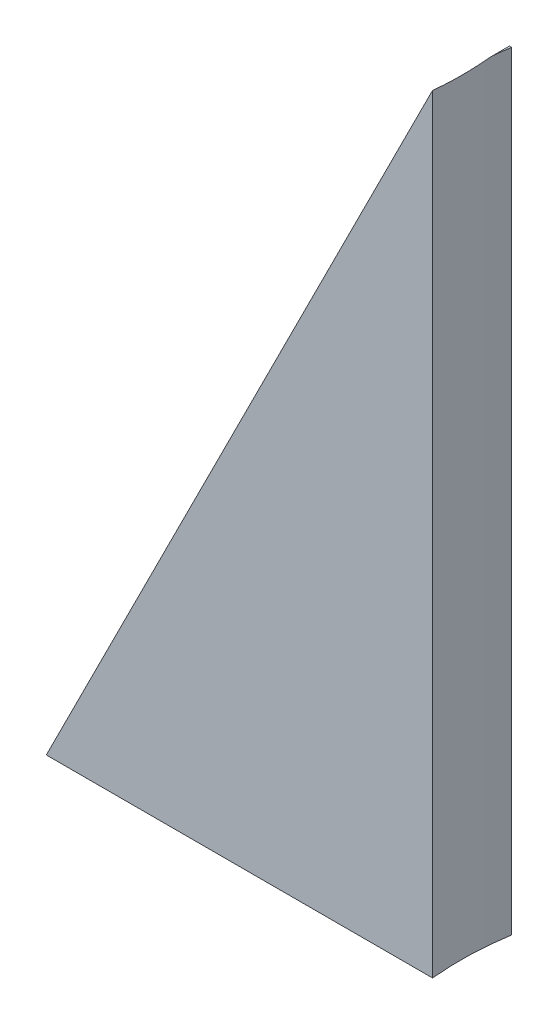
ISO-10303-21;
HEADER;
FILE_DESCRIPTION(('STEP AP214'),'2;1');
FILE_NAME('part.step','',(''),(''),'','','');
FILE_SCHEMA(('AUTOMOTIVE_DESIGN { 1 0 10303 214 1 1 1 1 }'));
ENDSEC;
DATA;
#1=APPLICATION_CONTEXT('core data for automotive mechanical design processes');
#2=APPLICATION_PROTOCOL_DEFINITION('international standard','automotive_design',2000,#1);
#3=PRODUCT_CONTEXT('',#1,'mechanical');
#4=PRODUCT('Part','Part','',(#3));
#5=PRODUCT_RELATED_PRODUCT_CATEGORY('part','',(#4));
#6=PRODUCT_DEFINITION_FORMATION('','',#4);
#7=PRODUCT_DEFINITION_CONTEXT('part definition',#1,'design');
#8=PRODUCT_DEFINITION('design','',#6,#7);
#9=PRODUCT_DEFINITION_SHAPE('','',#8);
#10=(LENGTH_UNIT() NAMED_UNIT(*) SI_UNIT(.MILLI.,.METRE.));
#11=(NAMED_UNIT(*) PLANE_ANGLE_UNIT() SI_UNIT($,.RADIAN.));
#12=(NAMED_UNIT(*) SI_UNIT($,.STERADIAN.) SOLID_ANGLE_UNIT());
#13=UNCERTAINTY_MEASURE_WITH_UNIT(LENGTH_MEASURE(1.E-05),#10,'distance_accuracy_value','');
#14=(GEOMETRIC_REPRESENTATION_CONTEXT(3) GLOBAL_UNCERTAINTY_ASSIGNED_CONTEXT((#13)) GLOBAL_UNIT_ASSIGNED_CONTEXT((#10,
#11,#12)) REPRESENTATION_CONTEXT('',''));
#15=CARTESIAN_POINT('',(0.,0.,0.));
#16=DIRECTION('',(0.,0.,1.));
#17=DIRECTION('',(1.,0.,0.));
#18=AXIS2_PLACEMENT_3D('',#15,#16,#17);
#19=CARTESIAN_POINT('',(127.612782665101,200.,2.25));
#20=DIRECTION('',(0.,-1.,0.));
#21=DIRECTION('',(0.,0.,-1.));
#22=AXIS2_PLACEMENT_3D('',#19,#20,#21);
#23=CYLINDRICAL_SURFACE('',#22,77.5);
#24=CARTESIAN_POINT('',(127.612782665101,353.453855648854,2.25));
#25=DIRECTION('',(0.893529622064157,-0.449004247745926,0.));
#26=DIRECTION('',(-0.449004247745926,-0.893529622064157,0.));
#27=AXIS2_PLACEMENT_3D('',#24,#25,#26);
#28=ELLIPSE('',#27,172.604157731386,77.5);
#29=CARTESIAN_POINT('',(50.5012562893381,200.,10.));
#30=VERTEX_POINT('',#29);
#31=CARTESIAN_POINT('',(50.5012562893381,200.,-5.50000000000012));
#32=VERTEX_POINT('',#31);
#33=EDGE_CURVE('E79',#30,#32,#28,.T.);
#34=ORIENTED_EDGE('',*,*,#33,.F.);
#35=DIRECTION('',(0.,-1.,0.));
#36=VECTOR('',#35,1.);
#37=CARTESIAN_POINT('',(50.5012562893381,200.,10.));
#38=LINE('',#37,#36);
#39=CARTESIAN_POINT('',(50.5012562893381,0.,10.));
#40=VERTEX_POINT('',#39);
#41=EDGE_CURVE('E48',#30,#40,#38,.T.);
#42=ORIENTED_EDGE('',*,*,#41,.T.);
#43=CARTESIAN_POINT('',(127.612782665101,0.,2.25));
#44=DIRECTION('',(0.,1.,0.));
#45=DIRECTION('',(0.,0.,1.));
#46=AXIS2_PLACEMENT_3D('',#43,#44,#45);
#47=CIRCLE('',#46,77.5);
#48=CARTESIAN_POINT('',(51.0870516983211,0.,-9.99999999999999));
#49=VERTEX_POINT('',#48);
#50=EDGE_CURVE('E87',#49,#40,#47,.T.);
#51=ORIENTED_EDGE('',*,*,#50,.F.);
#52=DIRECTION('',(0.,-1.,0.));
#53=VECTOR('',#52,1.);
#54=CARTESIAN_POINT('',(51.0870516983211,200.,-9.99999999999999));
#55=LINE('',#54,#53);
#56=CARTESIAN_POINT('',(51.0870516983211,200.,-9.99999999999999));
#57=VERTEX_POINT('',#56);
#58=EDGE_CURVE('E11',#57,#49,#55,.T.);
#59=ORIENTED_EDGE('',*,*,#58,.F.);
#60=CARTESIAN_POINT('',(127.612782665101,200.,2.25));
#61=DIRECTION('',(0.,1.,0.));
#62=DIRECTION('',(0.,0.,1.));
#63=AXIS2_PLACEMENT_3D('',#60,#61,#62);
#64=CIRCLE('',#63,77.5);
#65=EDGE_CURVE('E94',#57,#32,#64,.T.);
#66=ORIENTED_EDGE('',*,*,#65,.T.);
#67=EDGE_LOOP('',(#34,#42,#51,#59,#66));
#68=FACE_BOUND('',#67,.T.);
#69=ADVANCED_FACE('F40',(#68),#23,.F.);
#70=CARTESIAN_POINT('',(0.,200.,-9.99999999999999));
#71=DIRECTION('',(0.,0.,-1.));
#72=DIRECTION('',(-1.,0.,0.));
#73=AXIS2_PLACEMENT_3D('',#70,#71,#72);
#74=PLANE('',#73);
#75=DIRECTION('',(-0.449004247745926,-0.893529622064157,0.));
#76=VECTOR('',#75,1.);
#77=CARTESIAN_POINT('',(40.3199598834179,179.738966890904,-9.99999999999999));
#78=LINE('',#77,#76);
#79=CARTESIAN_POINT('',(50.5012562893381,200.,-10.));
#80=VERTEX_POINT('',#79);
#81=CARTESIAN_POINT('',(-50.,0.,-9.99999999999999));
#82=VERTEX_POINT('',#81);
#83=EDGE_CURVE('E67',#80,#82,#78,.T.);
#84=ORIENTED_EDGE('',*,*,#83,.F.);
#85=DIRECTION('',(1.,0.,0.));
#86=VECTOR('',#85,1.);
#87=CARTESIAN_POINT('',(0.,200.,-9.99999999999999));
#88=LINE('',#87,#86);
#89=EDGE_CURVE('E54',#80,#57,#88,.T.);
#90=ORIENTED_EDGE('',*,*,#89,.T.);
#91=ORIENTED_EDGE('',*,*,#58,.T.);
#92=DIRECTION('',(1.,0.,0.));
#93=VECTOR('',#92,1.);
#94=CARTESIAN_POINT('',(0.,0.,-9.99999999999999));
#95=LINE('',#94,#93);
#96=EDGE_CURVE('E82',#82,#49,#95,.T.);
#97=ORIENTED_EDGE('',*,*,#96,.F.);
#98=EDGE_LOOP('',(#84,#90,#91,#97));
#99=FACE_BOUND('',#98,.T.);
#100=ADVANCED_FACE('F83',(#99),#74,.T.);
#101=CARTESIAN_POINT('',(0.,200.,10.));
#102=DIRECTION('',(0.,0.,-1.));
#103=DIRECTION('',(-1.,0.,0.));
#104=AXIS2_PLACEMENT_3D('',#101,#102,#103);
#105=PLANE('',#104);
#106=ORIENTED_EDGE('',*,*,#41,.F.);
#107=DIRECTION('',(0.449004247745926,0.893529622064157,0.));
#108=VECTOR('',#107,1.);
#109=CARTESIAN_POINT('',(-39.9197592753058,20.0599297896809,10.));
#110=LINE('',#109,#108);
#111=CARTESIAN_POINT('',(-50.,0.,10.));
#112=VERTEX_POINT('',#111);
#113=EDGE_CURVE('E106',#112,#30,#110,.T.);
#114=ORIENTED_EDGE('',*,*,#113,.F.);
#115=DIRECTION('',(1.,0.,0.));
#116=VECTOR('',#115,1.);
#117=CARTESIAN_POINT('',(0.,0.,10.));
#118=LINE('',#117,#116);
#119=EDGE_CURVE('E92',#112,#40,#118,.T.);
#120=ORIENTED_EDGE('',*,*,#119,.T.);
#121=EDGE_LOOP('',(#106,#114,#120));
#122=FACE_BOUND('',#121,.T.);
#123=ADVANCED_FACE('F111',(#122),#105,.F.);
#124=CARTESIAN_POINT('',(0.,200.,0.));
#125=DIRECTION('',(0.,1.,0.));
#126=DIRECTION('',(0.,0.,1.));
#127=AXIS2_PLACEMENT_3D('',#124,#125,#126);
#128=PLANE('',#127);
#129=DIRECTION('',(0.,0.,1.));
#130=VECTOR('',#129,1.);
#131=CARTESIAN_POINT('',(50.5012562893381,200.,-190.));
#132=LINE('',#131,#130);
#133=EDGE_CURVE('E78',#80,#32,#132,.T.);
#134=ORIENTED_EDGE('',*,*,#133,.T.);
#135=ORIENTED_EDGE('',*,*,#65,.F.);
#136=ORIENTED_EDGE('',*,*,#89,.F.);
#137=EDGE_LOOP('',(#134,#135,#136));
#138=FACE_BOUND('',#137,.T.);
#139=ADVANCED_FACE('F113',(#138),#128,.T.);
#140=CARTESIAN_POINT('',(0.,0.,0.));
#141=DIRECTION('',(0.,1.,0.));
#142=DIRECTION('',(0.,0.,1.));
#143=AXIS2_PLACEMENT_3D('',#140,#141,#142);
#144=PLANE('',#143);
#145=ORIENTED_EDGE('',*,*,#50,.T.);
#146=ORIENTED_EDGE('',*,*,#119,.F.);
#147=DIRECTION('',(0.,0.,-1.));
#148=VECTOR('',#147,1.);
#149=CARTESIAN_POINT('',(-50.,0.,0.));
#150=LINE('',#149,#148);
#151=EDGE_CURVE('E74',#112,#82,#150,.T.);
#152=ORIENTED_EDGE('',*,*,#151,.T.);
#153=ORIENTED_EDGE('',*,*,#96,.T.);
#154=EDGE_LOOP('',(#145,#146,#152,#153));
#155=FACE_BOUND('',#154,.T.);
#156=ADVANCED_FACE('F90',(#155),#144,.F.);
#157=CARTESIAN_POINT('',(-39.9197592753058,20.0599297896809,-190.));
#158=DIRECTION('',(0.893529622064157,-0.449004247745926,0.));
#159=DIRECTION('',(0.449004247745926,0.893529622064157,0.));
#160=AXIS2_PLACEMENT_3D('',#157,#158,#159);
#161=PLANE('',#160);
#162=ORIENTED_EDGE('',*,*,#33,.T.);
#163=ORIENTED_EDGE('',*,*,#133,.F.);
#164=ORIENTED_EDGE('',*,*,#83,.T.);
#165=ORIENTED_EDGE('',*,*,#151,.F.);
#166=ORIENTED_EDGE('',*,*,#113,.T.);
#167=EDGE_LOOP('',(#162,#163,#164,#165,#166));
#168=FACE_BOUND('',#167,.T.);
#169=ADVANCED_FACE('F70',(#168),#161,.F.);
#170=CLOSED_SHELL('',(#69,#100,#123,#139,#156,#169));
#171=MANIFOLD_SOLID_BREP('B2',#170);
#172=ADVANCED_BREP_SHAPE_REPRESENTATION('',(#18,#171),#14);
#173=SHAPE_DEFINITION_REPRESENTATION(#9,#172);
ENDSEC;
END-ISO-10303-21;
